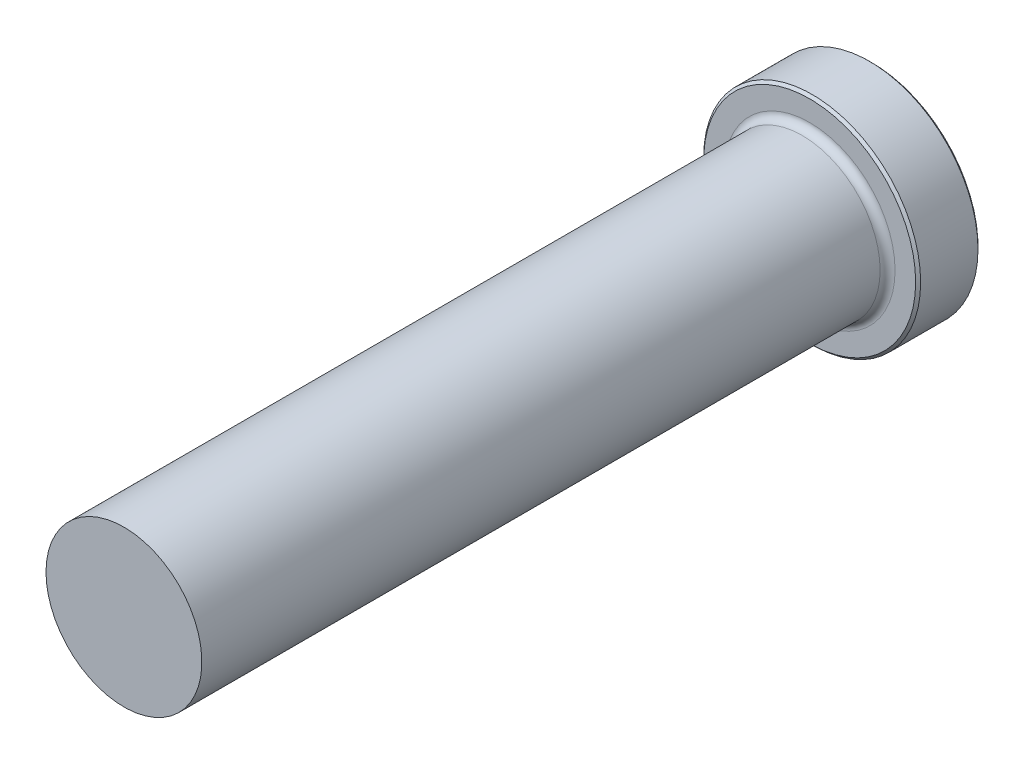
ISO-10303-21;
HEADER;
FILE_DESCRIPTION(('STEP AP214'),'2;1');
FILE_NAME('part.step','',(''),(''),'','','');
FILE_SCHEMA(('AUTOMOTIVE_DESIGN { 1 0 10303 214 1 1 1 1 }'));
ENDSEC;
DATA;
#1=APPLICATION_CONTEXT('core data for automotive mechanical design processes');
#2=APPLICATION_PROTOCOL_DEFINITION('international standard','automotive_design',2000,#1);
#3=PRODUCT_CONTEXT('',#1,'mechanical');
#4=PRODUCT('Part','Part','',(#3));
#5=PRODUCT_RELATED_PRODUCT_CATEGORY('part','',(#4));
#6=PRODUCT_DEFINITION_FORMATION('','',#4);
#7=PRODUCT_DEFINITION_CONTEXT('part definition',#1,'design');
#8=PRODUCT_DEFINITION('design','',#6,#7);
#9=PRODUCT_DEFINITION_SHAPE('','',#8);
#10=(LENGTH_UNIT() NAMED_UNIT(*) SI_UNIT(.MILLI.,.METRE.));
#11=(NAMED_UNIT(*) PLANE_ANGLE_UNIT() SI_UNIT($,.RADIAN.));
#12=(NAMED_UNIT(*) SI_UNIT($,.STERADIAN.) SOLID_ANGLE_UNIT());
#13=UNCERTAINTY_MEASURE_WITH_UNIT(LENGTH_MEASURE(1.E-05),#10,'distance_accuracy_value','');
#14=(GEOMETRIC_REPRESENTATION_CONTEXT(3) GLOBAL_UNCERTAINTY_ASSIGNED_CONTEXT((#13)) GLOBAL_UNIT_ASSIGNED_CONTEXT((#10,
#11,#12)) REPRESENTATION_CONTEXT('',''));
#15=CARTESIAN_POINT('',(0.,0.,0.));
#16=DIRECTION('',(0.,0.,1.));
#17=DIRECTION('',(1.,0.,0.));
#18=AXIS2_PLACEMENT_3D('',#15,#16,#17);
#19=CARTESIAN_POINT('',(0.,0.,0.));
#20=DIRECTION('',(0.,0.,-1.));
#21=DIRECTION('',(-1.,0.,0.));
#22=AXIS2_PLACEMENT_3D('',#19,#20,#21);
#23=PLANE('',#22);
#24=CARTESIAN_POINT('',(0.,0.,0.));
#25=DIRECTION('',(0.,0.,-1.));
#26=DIRECTION('',(-1.,0.,0.));
#27=AXIS2_PLACEMENT_3D('',#24,#25,#26);
#28=CIRCLE('',#27,10.795);
#29=CARTESIAN_POINT('',(-10.795,0.,0.));
#30=VERTEX_POINT('',#29);
#31=EDGE_CURVE('E50',#30,#30,#28,.T.);
#32=ORIENTED_EDGE('',*,*,#31,.T.);
#33=EDGE_LOOP('',(#32));
#34=FACE_BOUND('',#33,.T.);
#35=ADVANCED_FACE('F35',(#34),#23,.T.);
#36=CARTESIAN_POINT('',(0.,0.,0.));
#37=DIRECTION('',(0.,0.,-1.));
#38=DIRECTION('',(-1.,0.,0.));
#39=AXIS2_PLACEMENT_3D('',#36,#37,#38);
#40=CYLINDRICAL_SURFACE('',#39,11.049);
#41=CARTESIAN_POINT('',(0.,0.,0.254000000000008));
#42=DIRECTION('',(0.,0.,-1.));
#43=DIRECTION('',(-1.,0.,0.));
#44=AXIS2_PLACEMENT_3D('',#41,#42,#43);
#45=CIRCLE('',#44,11.049);
#46=CARTESIAN_POINT('',(-11.049,0.,0.254000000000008));
#47=VERTEX_POINT('',#46);
#48=EDGE_CURVE('E42',#47,#47,#45,.F.);
#49=ORIENTED_EDGE('',*,*,#48,.T.);
#50=EDGE_LOOP('',(#49));
#51=FACE_BOUND('',#50,.T.);
#52=CARTESIAN_POINT('',(0.,0.,6.09600000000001));
#53=DIRECTION('',(0.,0.,1.));
#54=DIRECTION('',(1.,0.,0.));
#55=AXIS2_PLACEMENT_3D('',#52,#53,#54);
#56=CIRCLE('',#55,11.049);
#57=CARTESIAN_POINT('',(11.049,0.,6.09600000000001));
#58=VERTEX_POINT('',#57);
#59=EDGE_CURVE('E46',#58,#58,#56,.F.);
#60=ORIENTED_EDGE('',*,*,#59,.T.);
#61=EDGE_LOOP('',(#60));
#62=FACE_BOUND('',#61,.T.);
#63=ADVANCED_FACE('F82',(#51,#62),#40,.T.);
#64=CARTESIAN_POINT('',(0.,11.049,6.35));
#65=DIRECTION('',(0.,0.,1.));
#66=DIRECTION('',(1.,0.,0.));
#67=AXIS2_PLACEMENT_3D('',#64,#65,#66);
#68=PLANE('',#67);
#69=CARTESIAN_POINT('',(0.,0.,6.35));
#70=DIRECTION('',(0.,0.,1.));
#71=DIRECTION('',(1.,0.,0.));
#72=AXIS2_PLACEMENT_3D('',#69,#70,#71);
#73=CIRCLE('',#72,10.795);
#74=CARTESIAN_POINT('',(10.795,0.,6.35));
#75=VERTEX_POINT('',#74);
#76=EDGE_CURVE('E10',#75,#75,#73,.T.);
#77=ORIENTED_EDGE('',*,*,#76,.T.);
#78=EDGE_LOOP('',(#77));
#79=FACE_BOUND('',#78,.T.);
#80=CARTESIAN_POINT('',(0.,0.,6.35));
#81=DIRECTION('',(0.,0.,1.));
#82=DIRECTION('',(1.,0.,0.));
#83=AXIS2_PLACEMENT_3D('',#80,#81,#82);
#84=CIRCLE('',#83,8.6995);
#85=CARTESIAN_POINT('',(8.6995,0.,6.35));
#86=VERTEX_POINT('',#85);
#87=EDGE_CURVE('E58',#86,#86,#84,.F.);
#88=ORIENTED_EDGE('',*,*,#87,.T.);
#89=EDGE_LOOP('',(#88));
#90=FACE_BOUND('',#89,.T.);
#91=ADVANCED_FACE('F78',(#79,#90),#68,.T.);
#92=CARTESIAN_POINT('',(0.,0.,0.));
#93=DIRECTION('',(0.,0.,-1.));
#94=DIRECTION('',(-1.,0.,0.));
#95=AXIS2_PLACEMENT_3D('',#92,#93,#94);
#96=CYLINDRICAL_SURFACE('',#95,7.9375);
#97=CARTESIAN_POINT('',(0.,0.,7.112));
#98=DIRECTION('',(0.,0.,1.));
#99=DIRECTION('',(1.,0.,0.));
#100=AXIS2_PLACEMENT_3D('',#97,#98,#99);
#101=CIRCLE('',#100,7.9375);
#102=CARTESIAN_POINT('',(7.9375,0.,7.112));
#103=VERTEX_POINT('',#102);
#104=EDGE_CURVE('E55',#103,#103,#101,.T.);
#105=ORIENTED_EDGE('',*,*,#104,.T.);
#106=EDGE_LOOP('',(#105));
#107=FACE_BOUND('',#106,.T.);
#108=CARTESIAN_POINT('',(0.,0.,76.2));
#109=DIRECTION('',(0.,0.,-1.));
#110=DIRECTION('',(-1.,0.,0.));
#111=AXIS2_PLACEMENT_3D('',#108,#109,#110);
#112=CIRCLE('',#111,7.93749999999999);
#113=CARTESIAN_POINT('',(-7.93749999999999,0.,76.2));
#114=VERTEX_POINT('',#113);
#115=EDGE_CURVE('E61',#114,#114,#112,.T.);
#116=ORIENTED_EDGE('',*,*,#115,.T.);
#117=EDGE_LOOP('',(#116));
#118=FACE_BOUND('',#117,.T.);
#119=ADVANCED_FACE('F65',(#107,#118),#96,.T.);
#120=CARTESIAN_POINT('',(0.,7.93749999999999,76.2));
#121=DIRECTION('',(0.,0.,1.));
#122=DIRECTION('',(1.,0.,0.));
#123=AXIS2_PLACEMENT_3D('',#120,#121,#122);
#124=PLANE('',#123);
#125=ORIENTED_EDGE('',*,*,#115,.F.);
#126=EDGE_LOOP('',(#125));
#127=FACE_BOUND('',#126,.T.);
#128=ADVANCED_FACE('F67',(#127),#124,.T.);
#129=CARTESIAN_POINT('',(0.,0.,7.112));
#130=DIRECTION('',(0.,0.,1.));
#131=DIRECTION('',(1.,0.,0.));
#132=AXIS2_PLACEMENT_3D('',#129,#130,#131);
#133=TOROIDAL_SURFACE('',#132,8.6995,0.762);
#134=ORIENTED_EDGE('',*,*,#104,.F.);
#135=EDGE_LOOP('',(#134));
#136=FACE_BOUND('',#135,.T.);
#137=ORIENTED_EDGE('',*,*,#87,.F.);
#138=EDGE_LOOP('',(#137));
#139=FACE_BOUND('',#138,.T.);
#140=ADVANCED_FACE('F69',(#136,#139),#133,.F.);
#141=CARTESIAN_POINT('',(0.,0.,0.));
#142=DIRECTION('',(0.,0.,1.));
#143=DIRECTION('',(1.,0.,0.));
#144=AXIS2_PLACEMENT_3D('',#141,#142,#143);
#145=CONICAL_SURFACE('',#144,10.795,0.785398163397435);
#146=ORIENTED_EDGE('',*,*,#48,.F.);
#147=EDGE_LOOP('',(#146));
#148=FACE_BOUND('',#147,.T.);
#149=ORIENTED_EDGE('',*,*,#31,.F.);
#150=EDGE_LOOP('',(#149));
#151=FACE_BOUND('',#150,.T.);
#152=ADVANCED_FACE('F75',(#148,#151),#145,.T.);
#153=CARTESIAN_POINT('',(0.,0.,6.09600000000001));
#154=DIRECTION('',(0.,0.,-1.));
#155=DIRECTION('',(-1.,0.,0.));
#156=AXIS2_PLACEMENT_3D('',#153,#154,#155);
#157=CONICAL_SURFACE('',#156,11.049,0.785398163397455);
#158=ORIENTED_EDGE('',*,*,#76,.F.);
#159=EDGE_LOOP('',(#158));
#160=FACE_BOUND('',#159,.T.);
#161=ORIENTED_EDGE('',*,*,#59,.F.);
#162=EDGE_LOOP('',(#161));
#163=FACE_BOUND('',#162,.T.);
#164=ADVANCED_FACE('F37',(#160,#163),#157,.T.);
#165=CLOSED_SHELL('',(#35,#63,#91,#119,#128,#140,#152,#164));
#166=MANIFOLD_SOLID_BREP('B2',#165);
#167=ADVANCED_BREP_SHAPE_REPRESENTATION('',(#18,#166),#14);
#168=SHAPE_DEFINITION_REPRESENTATION(#9,#167);
ENDSEC;
END-ISO-10303-21;
